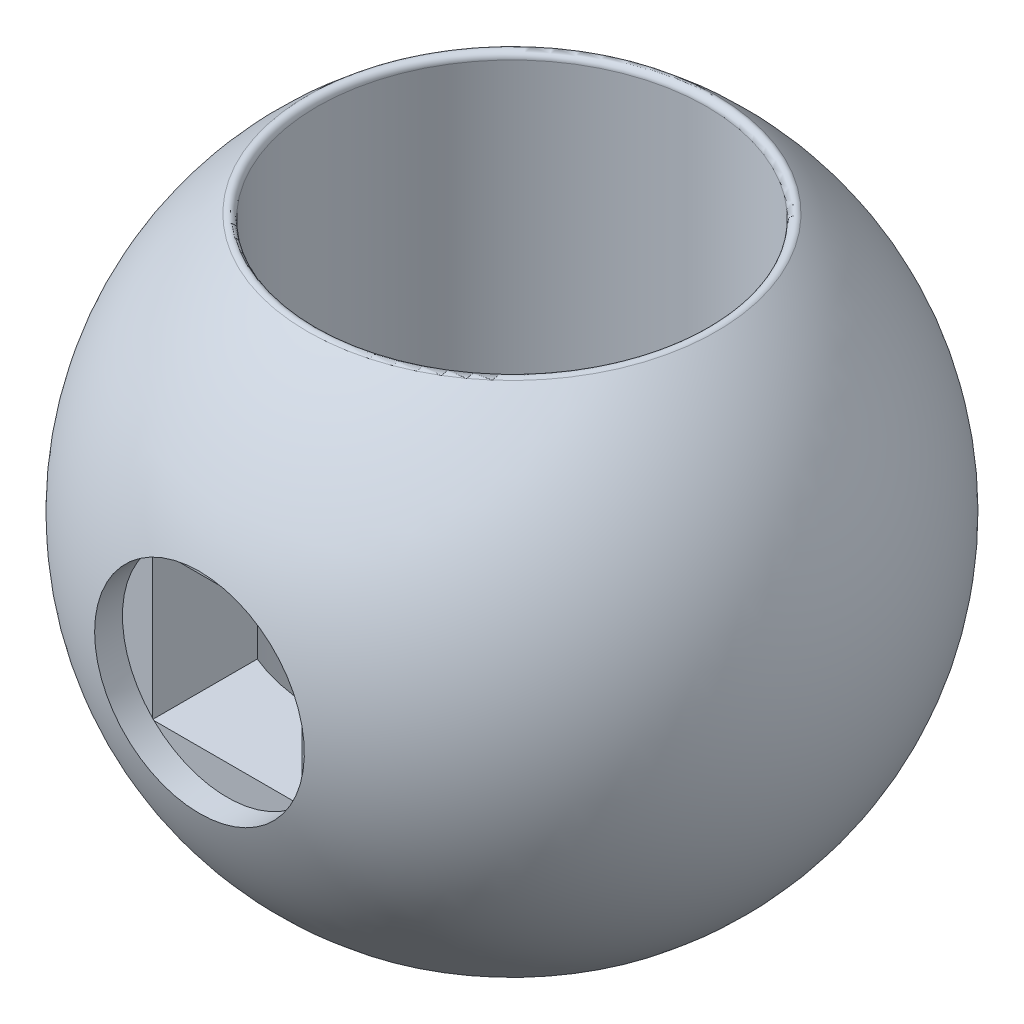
ISO-10303-21;
HEADER;
FILE_DESCRIPTION(('STEP AP214'),'2;1');
FILE_NAME('part.step','',(''),(''),'','','');
FILE_SCHEMA(('AUTOMOTIVE_DESIGN { 1 0 10303 214 1 1 1 1 }'));
ENDSEC;
DATA;
#1=APPLICATION_CONTEXT('core data for automotive mechanical design processes');
#2=APPLICATION_PROTOCOL_DEFINITION('international standard','automotive_design',2000,#1);
#3=PRODUCT_CONTEXT('',#1,'mechanical');
#4=PRODUCT('Part','Part','',(#3));
#5=PRODUCT_RELATED_PRODUCT_CATEGORY('part','',(#4));
#6=PRODUCT_DEFINITION_FORMATION('','',#4);
#7=PRODUCT_DEFINITION_CONTEXT('part definition',#1,'design');
#8=PRODUCT_DEFINITION('design','',#6,#7);
#9=PRODUCT_DEFINITION_SHAPE('','',#8);
#10=(LENGTH_UNIT() NAMED_UNIT(*) SI_UNIT(.MILLI.,.METRE.));
#11=(NAMED_UNIT(*) PLANE_ANGLE_UNIT() SI_UNIT($,.RADIAN.));
#12=(NAMED_UNIT(*) SI_UNIT($,.STERADIAN.) SOLID_ANGLE_UNIT());
#13=UNCERTAINTY_MEASURE_WITH_UNIT(LENGTH_MEASURE(1.E-05),#10,'distance_accuracy_value','');
#14=(GEOMETRIC_REPRESENTATION_CONTEXT(3) GLOBAL_UNCERTAINTY_ASSIGNED_CONTEXT((#13)) GLOBAL_UNIT_ASSIGNED_CONTEXT((#10,
#11,#12)) REPRESENTATION_CONTEXT('',''));
#15=CARTESIAN_POINT('',(0.,0.,0.));
#16=DIRECTION('',(0.,0.,1.));
#17=DIRECTION('',(1.,0.,0.));
#18=AXIS2_PLACEMENT_3D('',#15,#16,#17);
#19=CARTESIAN_POINT('',(0.,0.,9.5));
#20=DIRECTION('',(0.,0.,1.));
#21=DIRECTION('',(1.,0.,0.));
#22=AXIS2_PLACEMENT_3D('',#19,#20,#21);
#23=PLANE('',#22);
#24=DIRECTION('',(0.,1.,0.));
#25=VECTOR('',#24,1.);
#26=CARTESIAN_POINT('',(2.5,0.,9.5));
#27=LINE('',#26,#25);
#28=CARTESIAN_POINT('',(2.5,-2.44948974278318,9.5));
#29=VERTEX_POINT('',#28);
#30=CARTESIAN_POINT('',(2.5,2.44948974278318,9.5));
#31=VERTEX_POINT('',#30);
#32=EDGE_CURVE('E11',#29,#31,#27,.T.);
#33=ORIENTED_EDGE('',*,*,#32,.F.);
#34=CARTESIAN_POINT('',(0.,0.,9.5));
#35=DIRECTION('',(0.,0.,1.));
#36=DIRECTION('',(1.,0.,0.));
#37=AXIS2_PLACEMENT_3D('',#34,#35,#36);
#38=CIRCLE('',#37,3.5);
#39=EDGE_CURVE('E139',#29,#31,#38,.T.);
#40=ORIENTED_EDGE('',*,*,#39,.T.);
#41=EDGE_LOOP('',(#33,#40));
#42=FACE_BOUND('',#41,.T.);
#43=ADVANCED_FACE('F32',(#42),#23,.T.);
#44=DIRECTION('',(1.,0.,0.));
#45=VECTOR('',#44,1.);
#46=CARTESIAN_POINT('',(0.,-2.5,9.5));
#47=LINE('',#46,#45);
#48=CARTESIAN_POINT('',(-2.44948974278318,-2.5,9.5));
#49=VERTEX_POINT('',#48);
#50=CARTESIAN_POINT('',(2.44948974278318,-2.5,9.5));
#51=VERTEX_POINT('',#50);
#52=EDGE_CURVE('E40',#49,#51,#47,.T.);
#53=ORIENTED_EDGE('',*,*,#52,.F.);
#54=EDGE_CURVE('E178',#49,#51,#38,.T.);
#55=ORIENTED_EDGE('',*,*,#54,.T.);
#56=EDGE_LOOP('',(#53,#55));
#57=FACE_BOUND('',#56,.T.);
#58=ADVANCED_FACE('F180',(#57),#23,.T.);
#59=DIRECTION('',(0.,-1.,0.));
#60=VECTOR('',#59,1.);
#61=CARTESIAN_POINT('',(-2.5,0.,9.5));
#62=LINE('',#61,#60);
#63=CARTESIAN_POINT('',(-2.5,2.44948974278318,9.5));
#64=VERTEX_POINT('',#63);
#65=CARTESIAN_POINT('',(-2.5,-2.44948974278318,9.5));
#66=VERTEX_POINT('',#65);
#67=EDGE_CURVE('E159',#64,#66,#62,.T.);
#68=ORIENTED_EDGE('',*,*,#67,.F.);
#69=EDGE_CURVE('E182',#64,#66,#38,.T.);
#70=ORIENTED_EDGE('',*,*,#69,.T.);
#71=EDGE_LOOP('',(#68,#70));
#72=FACE_BOUND('',#71,.T.);
#73=ADVANCED_FACE('F199',(#72),#23,.T.);
#74=CARTESIAN_POINT('',(0.,0.,0.));
#75=DIRECTION('',(0.,-1.,0.));
#76=DIRECTION('',(1.,0.,0.));
#77=AXIS2_PLACEMENT_3D('',#74,#75,#76);
#78=SPHERICAL_SURFACE('',#77,11.);
#79=CARTESIAN_POINT('',(0.,0.,10.4283268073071));
#80=DIRECTION('',(0.,0.,-1.));
#81=DIRECTION('',(-1.,0.,0.));
#82=AXIS2_PLACEMENT_3D('',#79,#80,#81);
#83=CIRCLE('',#82,3.5);
#84=CARTESIAN_POINT('',(-3.5,0.,10.4283268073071));
#85=VERTEX_POINT('',#84);
#86=EDGE_CURVE('E141',#85,#85,#83,.F.);
#87=ORIENTED_EDGE('',*,*,#86,.F.);
#88=EDGE_LOOP('',(#87));
#89=FACE_BOUND('',#88,.T.);
#90=CARTESIAN_POINT('',(0.,8.62739897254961,0.));
#91=DIRECTION('',(0.,-1.,0.));
#92=DIRECTION('',(0.,0.,-1.));
#93=AXIS2_PLACEMENT_3D('',#90,#91,#92);
#94=CIRCLE('',#93,6.82407407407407);
#95=CARTESIAN_POINT('',(0.,8.62739897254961,-6.82407407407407));
#96=VERTEX_POINT('',#95);
#97=EDGE_CURVE('E146',#96,#96,#94,.T.);
#98=ORIENTED_EDGE('',*,*,#97,.T.);
#99=EDGE_LOOP('',(#98));
#100=FACE_BOUND('',#99,.T.);
#101=CARTESIAN_POINT('',(0.,-8.62739897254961,0.));
#102=DIRECTION('',(0.,1.,0.));
#103=DIRECTION('',(0.,0.,1.));
#104=AXIS2_PLACEMENT_3D('',#101,#102,#103);
#105=CIRCLE('',#104,6.82407407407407);
#106=CARTESIAN_POINT('',(0.,-8.62739897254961,6.82407407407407));
#107=VERTEX_POINT('',#106);
#108=EDGE_CURVE('E143',#107,#107,#105,.T.);
#109=ORIENTED_EDGE('',*,*,#108,.T.);
#110=EDGE_LOOP('',(#109));
#111=FACE_BOUND('',#110,.T.);
#112=ADVANCED_FACE('F201',(#89,#100,#111),#78,.T.);
#113=CARTESIAN_POINT('',(0.,0.,0.));
#114=DIRECTION('',(0.,-1.,0.));
#115=DIRECTION('',(0.,0.,-1.));
#116=AXIS2_PLACEMENT_3D('',#113,#114,#115);
#117=CYLINDRICAL_SURFACE('',#116,6.5);
#118=DIRECTION('',(0.,-1.,0.));
#119=VECTOR('',#118,1.);
#120=CARTESIAN_POINT('',(2.5,0.,6.));
#121=LINE('',#120,#119);
#122=CARTESIAN_POINT('',(2.5,2.5,6.));
#123=VERTEX_POINT('',#122);
#124=CARTESIAN_POINT('',(2.5,-2.5,6.));
#125=VERTEX_POINT('',#124);
#126=EDGE_CURVE('E137',#123,#125,#121,.T.);
#127=ORIENTED_EDGE('',*,*,#126,.F.);
#128=CARTESIAN_POINT('',(0.,2.5,0.));
#129=DIRECTION('',(0.,1.,0.));
#130=DIRECTION('',(0.,0.,1.));
#131=AXIS2_PLACEMENT_3D('',#128,#129,#130);
#132=CIRCLE('',#131,6.5);
#133=CARTESIAN_POINT('',(-2.5,2.5,6.));
#134=VERTEX_POINT('',#133);
#135=EDGE_CURVE('E109',#134,#123,#132,.T.);
#136=ORIENTED_EDGE('',*,*,#135,.F.);
#137=DIRECTION('',(0.,-1.,0.));
#138=VECTOR('',#137,1.);
#139=CARTESIAN_POINT('',(-2.5,0.,6.));
#140=LINE('',#139,#138);
#141=CARTESIAN_POINT('',(-2.5,-2.5,6.));
#142=VERTEX_POINT('',#141);
#143=EDGE_CURVE('E133',#142,#134,#140,.F.);
#144=ORIENTED_EDGE('',*,*,#143,.F.);
#145=CARTESIAN_POINT('',(0.,-2.5,0.));
#146=DIRECTION('',(0.,-1.,0.));
#147=DIRECTION('',(0.,0.,-1.));
#148=AXIS2_PLACEMENT_3D('',#145,#146,#147);
#149=CIRCLE('',#148,6.5);
#150=EDGE_CURVE('E135',#125,#142,#149,.T.);
#151=ORIENTED_EDGE('',*,*,#150,.F.);
#152=EDGE_LOOP('',(#127,#136,#144,#151));
#153=FACE_BOUND('',#152,.T.);
#154=CARTESIAN_POINT('',(0.,8.47053717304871,0.));
#155=DIRECTION('',(0.,-1.,0.));
#156=DIRECTION('',(0.,0.,-1.));
#157=AXIS2_PLACEMENT_3D('',#154,#155,#156);
#158=CIRCLE('',#157,6.5);
#159=CARTESIAN_POINT('',(0.,8.47053717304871,-6.5));
#160=VERTEX_POINT('',#159);
#161=EDGE_CURVE('E152',#160,#160,#158,.F.);
#162=ORIENTED_EDGE('',*,*,#161,.T.);
#163=EDGE_LOOP('',(#162));
#164=FACE_BOUND('',#163,.T.);
#165=CARTESIAN_POINT('',(0.,-8.47053717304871,0.));
#166=DIRECTION('',(0.,1.,0.));
#167=DIRECTION('',(0.,0.,1.));
#168=AXIS2_PLACEMENT_3D('',#165,#166,#167);
#169=CIRCLE('',#168,6.5);
#170=CARTESIAN_POINT('',(0.,-8.47053717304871,6.5));
#171=VERTEX_POINT('',#170);
#172=EDGE_CURVE('E149',#171,#171,#169,.F.);
#173=ORIENTED_EDGE('',*,*,#172,.T.);
#174=EDGE_LOOP('',(#173));
#175=FACE_BOUND('',#174,.T.);
#176=ADVANCED_FACE('F207',(#153,#164,#175),#117,.F.);
#177=CARTESIAN_POINT('',(0.,8.47053717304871,0.));
#178=DIRECTION('',(0.,-1.,0.));
#179=DIRECTION('',(0.,0.,-1.));
#180=AXIS2_PLACEMENT_3D('',#177,#178,#179);
#181=TOROIDAL_SURFACE('',#180,6.7,0.2);
#182=ORIENTED_EDGE('',*,*,#161,.F.);
#183=EDGE_LOOP('',(#182));
#184=FACE_BOUND('',#183,.T.);
#185=ORIENTED_EDGE('',*,*,#97,.F.);
#186=EDGE_LOOP('',(#185));
#187=FACE_BOUND('',#186,.T.);
#188=ADVANCED_FACE('F237',(#184,#187),#181,.T.);
#189=CARTESIAN_POINT('',(0.,-8.47053717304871,0.));
#190=DIRECTION('',(0.,1.,0.));
#191=DIRECTION('',(0.,0.,1.));
#192=AXIS2_PLACEMENT_3D('',#189,#190,#191);
#193=TOROIDAL_SURFACE('',#192,6.7,0.2);
#194=ORIENTED_EDGE('',*,*,#108,.F.);
#195=EDGE_LOOP('',(#194));
#196=FACE_BOUND('',#195,.T.);
#197=ORIENTED_EDGE('',*,*,#172,.F.);
#198=EDGE_LOOP('',(#197));
#199=FACE_BOUND('',#198,.T.);
#200=ADVANCED_FACE('F34',(#196,#199),#193,.T.);
#201=CARTESIAN_POINT('',(0.,0.,9.5));
#202=DIRECTION('',(0.,0.,1.));
#203=DIRECTION('',(1.,0.,0.));
#204=AXIS2_PLACEMENT_3D('',#201,#202,#203);
#205=CYLINDRICAL_SURFACE('',#204,3.5);
#206=ORIENTED_EDGE('',*,*,#86,.T.);
#207=EDGE_LOOP('',(#206));
#208=FACE_BOUND('',#207,.T.);
#209=CARTESIAN_POINT('',(2.44948974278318,2.5,9.5));
#210=VERTEX_POINT('',#209);
#211=EDGE_CURVE('E114',#31,#210,#38,.T.);
#212=ORIENTED_EDGE('',*,*,#211,.F.);
#213=ORIENTED_EDGE('',*,*,#39,.F.);
#214=EDGE_CURVE('E175',#51,#29,#38,.T.);
#215=ORIENTED_EDGE('',*,*,#214,.F.);
#216=ORIENTED_EDGE('',*,*,#54,.F.);
#217=EDGE_CURVE('E181',#66,#49,#38,.T.);
#218=ORIENTED_EDGE('',*,*,#217,.F.);
#219=ORIENTED_EDGE('',*,*,#69,.F.);
#220=CARTESIAN_POINT('',(-2.44948974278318,2.5,9.5));
#221=VERTEX_POINT('',#220);
#222=EDGE_CURVE('E185',#221,#64,#38,.T.);
#223=ORIENTED_EDGE('',*,*,#222,.F.);
#224=EDGE_CURVE('E142',#210,#221,#38,.T.);
#225=ORIENTED_EDGE('',*,*,#224,.F.);
#226=EDGE_LOOP('',(#212,#213,#215,#216,#218,#219,#223,#225));
#227=FACE_BOUND('',#226,.T.);
#228=ADVANCED_FACE('F176',(#208,#227),#205,.F.);
#229=DIRECTION('',(-1.,0.,0.));
#230=VECTOR('',#229,1.);
#231=CARTESIAN_POINT('',(0.,2.5,9.5));
#232=LINE('',#231,#230);
#233=EDGE_CURVE('E155',#210,#221,#232,.T.);
#234=ORIENTED_EDGE('',*,*,#233,.F.);
#235=ORIENTED_EDGE('',*,*,#224,.T.);
#236=EDGE_LOOP('',(#234,#235));
#237=FACE_BOUND('',#236,.T.);
#238=ADVANCED_FACE('F195',(#237),#23,.T.);
#239=CARTESIAN_POINT('',(2.5,-2.5,9.5));
#240=DIRECTION('',(0.,0.,1.));
#241=DIRECTION('',(1.,0.,0.));
#242=AXIS2_PLACEMENT_3D('',#239,#240,#241);
#243=PLANE('',#242);
#244=DIRECTION('',(0.,1.,0.));
#245=VECTOR('',#244,1.);
#246=CARTESIAN_POINT('',(2.5,2.5,9.5));
#247=LINE('',#246,#245);
#248=CARTESIAN_POINT('',(2.5,-2.5,9.5));
#249=VERTEX_POINT('',#248);
#250=EDGE_CURVE('E105',#249,#29,#247,.T.);
#251=ORIENTED_EDGE('',*,*,#250,.F.);
#252=DIRECTION('',(1.,0.,0.));
#253=VECTOR('',#252,1.);
#254=CARTESIAN_POINT('',(-2.5,-2.5,9.5));
#255=LINE('',#254,#253);
#256=EDGE_CURVE('E124',#51,#249,#255,.T.);
#257=ORIENTED_EDGE('',*,*,#256,.F.);
#258=ORIENTED_EDGE('',*,*,#214,.T.);
#259=EDGE_LOOP('',(#251,#257,#258));
#260=FACE_BOUND('',#259,.T.);
#261=ADVANCED_FACE('F213',(#260),#243,.F.);
#262=CARTESIAN_POINT('',(-2.5,-2.5,9.5));
#263=VERTEX_POINT('',#262);
#264=EDGE_CURVE('E110',#263,#49,#255,.T.);
#265=ORIENTED_EDGE('',*,*,#264,.F.);
#266=DIRECTION('',(0.,-1.,0.));
#267=VECTOR('',#266,1.);
#268=CARTESIAN_POINT('',(-2.5,2.5,9.5));
#269=LINE('',#268,#267);
#270=EDGE_CURVE('E116',#66,#263,#269,.T.);
#271=ORIENTED_EDGE('',*,*,#270,.F.);
#272=ORIENTED_EDGE('',*,*,#217,.T.);
#273=EDGE_LOOP('',(#265,#271,#272));
#274=FACE_BOUND('',#273,.T.);
#275=ADVANCED_FACE('F265',(#274),#243,.F.);
#276=CARTESIAN_POINT('',(-2.5,2.5,9.5));
#277=VERTEX_POINT('',#276);
#278=EDGE_CURVE('E120',#277,#64,#269,.T.);
#279=ORIENTED_EDGE('',*,*,#278,.F.);
#280=DIRECTION('',(-1.,0.,0.));
#281=VECTOR('',#280,1.);
#282=CARTESIAN_POINT('',(-2.5,2.5,9.5));
#283=LINE('',#282,#281);
#284=EDGE_CURVE('E117',#221,#277,#283,.T.);
#285=ORIENTED_EDGE('',*,*,#284,.F.);
#286=ORIENTED_EDGE('',*,*,#222,.T.);
#287=EDGE_LOOP('',(#279,#285,#286));
#288=FACE_BOUND('',#287,.T.);
#289=ADVANCED_FACE('F196',(#288),#243,.F.);
#290=CARTESIAN_POINT('',(2.5,2.5,9.5));
#291=VERTEX_POINT('',#290);
#292=EDGE_CURVE('E54',#291,#210,#283,.T.);
#293=ORIENTED_EDGE('',*,*,#292,.F.);
#294=EDGE_CURVE('E97',#31,#291,#247,.T.);
#295=ORIENTED_EDGE('',*,*,#294,.F.);
#296=ORIENTED_EDGE('',*,*,#211,.T.);
#297=EDGE_LOOP('',(#293,#295,#296));
#298=FACE_BOUND('',#297,.T.);
#299=ADVANCED_FACE('F112',(#298),#243,.F.);
#300=CARTESIAN_POINT('',(2.5,2.5,-1.5));
#301=DIRECTION('',(1.,0.,0.));
#302=DIRECTION('',(0.,0.,-1.));
#303=AXIS2_PLACEMENT_3D('',#300,#301,#302);
#304=PLANE('',#303);
#305=ORIENTED_EDGE('',*,*,#126,.T.);
#306=DIRECTION('',(0.,0.,1.));
#307=VECTOR('',#306,1.);
#308=CARTESIAN_POINT('',(2.5,-2.5,-1.5));
#309=LINE('',#308,#307);
#310=EDGE_CURVE('E127',#125,#249,#309,.T.);
#311=ORIENTED_EDGE('',*,*,#310,.T.);
#312=ORIENTED_EDGE('',*,*,#250,.T.);
#313=ORIENTED_EDGE('',*,*,#32,.T.);
#314=ORIENTED_EDGE('',*,*,#294,.T.);
#315=DIRECTION('',(0.,0.,1.));
#316=VECTOR('',#315,1.);
#317=CARTESIAN_POINT('',(2.5,2.5,-1.5));
#318=LINE('',#317,#316);
#319=EDGE_CURVE('E99',#123,#291,#318,.T.);
#320=ORIENTED_EDGE('',*,*,#319,.F.);
#321=EDGE_LOOP('',(#305,#311,#312,#313,#314,#320));
#322=FACE_BOUND('',#321,.T.);
#323=ADVANCED_FACE('F98',(#322),#304,.F.);
#324=CARTESIAN_POINT('',(-2.5,-2.5,-1.5));
#325=DIRECTION('',(0.,-1.,0.));
#326=DIRECTION('',(0.,0.,-1.));
#327=AXIS2_PLACEMENT_3D('',#324,#325,#326);
#328=PLANE('',#327);
#329=ORIENTED_EDGE('',*,*,#150,.T.);
#330=DIRECTION('',(0.,0.,1.));
#331=VECTOR('',#330,1.);
#332=CARTESIAN_POINT('',(-2.5,-2.5,-1.5));
#333=LINE('',#332,#331);
#334=EDGE_CURVE('E129',#142,#263,#333,.T.);
#335=ORIENTED_EDGE('',*,*,#334,.T.);
#336=ORIENTED_EDGE('',*,*,#264,.T.);
#337=ORIENTED_EDGE('',*,*,#52,.T.);
#338=ORIENTED_EDGE('',*,*,#256,.T.);
#339=ORIENTED_EDGE('',*,*,#310,.F.);
#340=EDGE_LOOP('',(#329,#335,#336,#337,#338,#339));
#341=FACE_BOUND('',#340,.T.);
#342=ADVANCED_FACE('F166',(#341),#328,.F.);
#343=CARTESIAN_POINT('',(-2.5,2.5,-1.5));
#344=DIRECTION('',(-1.,0.,0.));
#345=DIRECTION('',(0.,0.,1.));
#346=AXIS2_PLACEMENT_3D('',#343,#344,#345);
#347=PLANE('',#346);
#348=ORIENTED_EDGE('',*,*,#143,.T.);
#349=DIRECTION('',(0.,0.,1.));
#350=VECTOR('',#349,1.);
#351=CARTESIAN_POINT('',(-2.5,2.5,-1.5));
#352=LINE('',#351,#350);
#353=EDGE_CURVE('E47',#134,#277,#352,.T.);
#354=ORIENTED_EDGE('',*,*,#353,.T.);
#355=ORIENTED_EDGE('',*,*,#278,.T.);
#356=ORIENTED_EDGE('',*,*,#67,.T.);
#357=ORIENTED_EDGE('',*,*,#270,.T.);
#358=ORIENTED_EDGE('',*,*,#334,.F.);
#359=EDGE_LOOP('',(#348,#354,#355,#356,#357,#358));
#360=FACE_BOUND('',#359,.T.);
#361=ADVANCED_FACE('F198',(#360),#347,.F.);
#362=CARTESIAN_POINT('',(-2.5,2.5,-1.5));
#363=DIRECTION('',(0.,1.,0.));
#364=DIRECTION('',(0.,0.,1.));
#365=AXIS2_PLACEMENT_3D('',#362,#363,#364);
#366=PLANE('',#365);
#367=ORIENTED_EDGE('',*,*,#135,.T.);
#368=ORIENTED_EDGE('',*,*,#319,.T.);
#369=ORIENTED_EDGE('',*,*,#292,.T.);
#370=ORIENTED_EDGE('',*,*,#233,.T.);
#371=ORIENTED_EDGE('',*,*,#284,.T.);
#372=ORIENTED_EDGE('',*,*,#353,.F.);
#373=EDGE_LOOP('',(#367,#368,#369,#370,#371,#372));
#374=FACE_BOUND('',#373,.T.);
#375=ADVANCED_FACE('F107',(#374),#366,.F.);
#376=CLOSED_SHELL('',(#43,#58,#73,#112,#176,#188,#200,#228,#238,#261,#275,#289,#299,#323,#342,
#361,#375));
#377=MANIFOLD_SOLID_BREP('B2',#376);
#378=ADVANCED_BREP_SHAPE_REPRESENTATION('',(#18,#377),#14);
#379=SHAPE_DEFINITION_REPRESENTATION(#9,#378);
ENDSEC;
END-ISO-10303-21;
